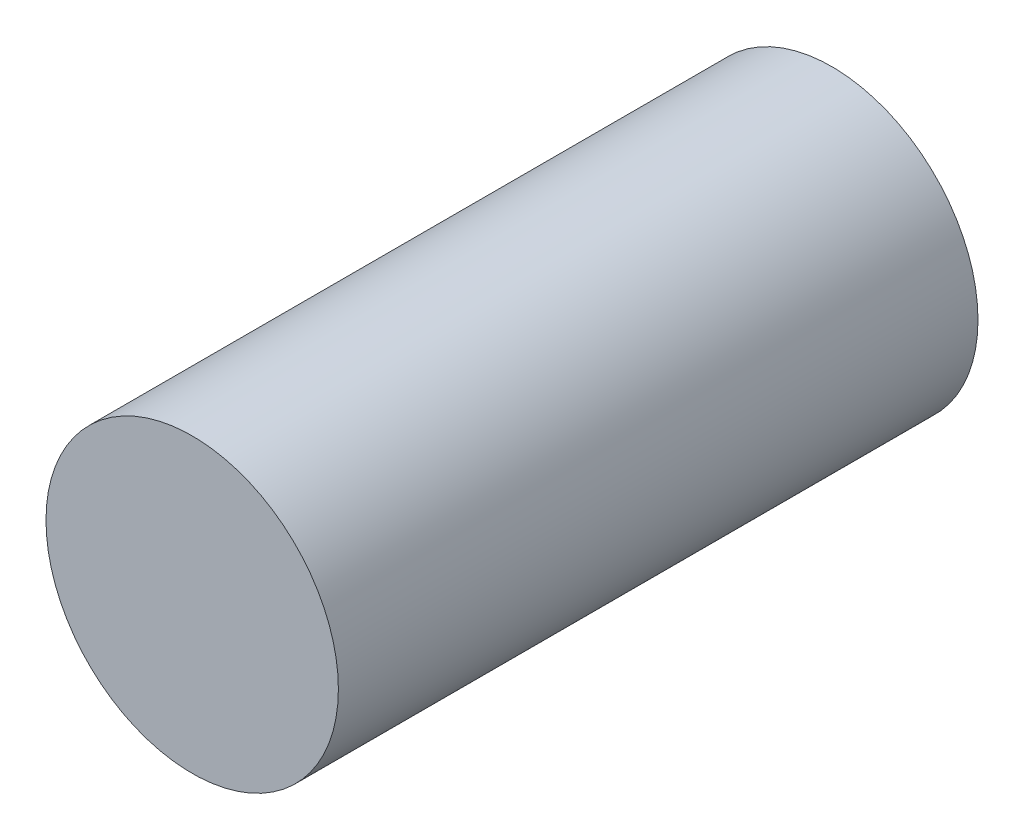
ISO-10303-21;
HEADER;
FILE_DESCRIPTION(('STEP AP214'),'2;1');
FILE_NAME('part.step','',(''),(''),'','','');
FILE_SCHEMA(('AUTOMOTIVE_DESIGN { 1 0 10303 214 1 1 1 1 }'));
ENDSEC;
DATA;
#1=APPLICATION_CONTEXT('core data for automotive mechanical design processes');
#2=APPLICATION_PROTOCOL_DEFINITION('international standard','automotive_design',2000,#1);
#3=PRODUCT_CONTEXT('',#1,'mechanical');
#4=PRODUCT('Part','Part','',(#3));
#5=PRODUCT_RELATED_PRODUCT_CATEGORY('part','',(#4));
#6=PRODUCT_DEFINITION_FORMATION('','',#4);
#7=PRODUCT_DEFINITION_CONTEXT('part definition',#1,'design');
#8=PRODUCT_DEFINITION('design','',#6,#7);
#9=PRODUCT_DEFINITION_SHAPE('','',#8);
#10=(LENGTH_UNIT() NAMED_UNIT(*) SI_UNIT(.MILLI.,.METRE.));
#11=(NAMED_UNIT(*) PLANE_ANGLE_UNIT() SI_UNIT($,.RADIAN.));
#12=(NAMED_UNIT(*) SI_UNIT($,.STERADIAN.) SOLID_ANGLE_UNIT());
#13=UNCERTAINTY_MEASURE_WITH_UNIT(LENGTH_MEASURE(1.E-05),#10,'distance_accuracy_value','');
#14=(GEOMETRIC_REPRESENTATION_CONTEXT(3) GLOBAL_UNCERTAINTY_ASSIGNED_CONTEXT((#13)) GLOBAL_UNIT_ASSIGNED_CONTEXT((#10,
#11,#12)) REPRESENTATION_CONTEXT('',''));
#15=CARTESIAN_POINT('',(0.,0.,0.));
#16=DIRECTION('',(0.,0.,1.));
#17=DIRECTION('',(1.,0.,0.));
#18=AXIS2_PLACEMENT_3D('',#15,#16,#17);
#19=CARTESIAN_POINT('',(0.,0.,3.5));
#20=DIRECTION('',(0.,0.,1.));
#21=DIRECTION('',(1.,0.,0.));
#22=AXIS2_PLACEMENT_3D('',#19,#20,#21);
#23=PLANE('',#22);
#24=CARTESIAN_POINT('',(0.,0.,3.5));
#25=DIRECTION('',(0.,0.,-1.));
#26=DIRECTION('',(-1.,0.,0.));
#27=AXIS2_PLACEMENT_3D('',#24,#25,#26);
#28=CIRCLE('',#27,1.6);
#29=CARTESIAN_POINT('',(-1.6,0.,3.5));
#30=VERTEX_POINT('',#29);
#31=EDGE_CURVE('E10',#30,#30,#28,.T.);
#32=ORIENTED_EDGE('',*,*,#31,.F.);
#33=EDGE_LOOP('',(#32));
#34=FACE_BOUND('',#33,.T.);
#35=ADVANCED_FACE('F15',(#34),#23,.T.);
#36=CARTESIAN_POINT('',(0.,0.,-3.5));
#37=DIRECTION('',(0.,0.,-1.));
#38=DIRECTION('',(-1.,0.,0.));
#39=AXIS2_PLACEMENT_3D('',#36,#37,#38);
#40=PLANE('',#39);
#41=CARTESIAN_POINT('',(0.,0.,-3.5));
#42=DIRECTION('',(0.,0.,1.));
#43=DIRECTION('',(1.,0.,0.));
#44=AXIS2_PLACEMENT_3D('',#41,#42,#43);
#45=CIRCLE('',#44,1.6);
#46=CARTESIAN_POINT('',(1.6,0.,-3.5));
#47=VERTEX_POINT('',#46);
#48=EDGE_CURVE('E22',#47,#47,#45,.T.);
#49=ORIENTED_EDGE('',*,*,#48,.F.);
#50=EDGE_LOOP('',(#49));
#51=FACE_BOUND('',#50,.T.);
#52=ADVANCED_FACE('F26',(#51),#40,.T.);
#53=CARTESIAN_POINT('',(0.,0.,-3.5));
#54=DIRECTION('',(0.,0.,1.));
#55=DIRECTION('',(1.,0.,0.));
#56=AXIS2_PLACEMENT_3D('',#53,#54,#55);
#57=CYLINDRICAL_SURFACE('',#56,1.6);
#58=ORIENTED_EDGE('',*,*,#31,.T.);
#59=EDGE_LOOP('',(#58));
#60=FACE_BOUND('',#59,.T.);
#61=ORIENTED_EDGE('',*,*,#48,.T.);
#62=EDGE_LOOP('',(#61));
#63=FACE_BOUND('',#62,.T.);
#64=ADVANCED_FACE('F17',(#60,#63),#57,.T.);
#65=CLOSED_SHELL('',(#35,#52,#64));
#66=MANIFOLD_SOLID_BREP('B1',#65);
#67=ADVANCED_BREP_SHAPE_REPRESENTATION('',(#18,#66),#14);
#68=SHAPE_DEFINITION_REPRESENTATION(#9,#67);
ENDSEC;
END-ISO-10303-21;
